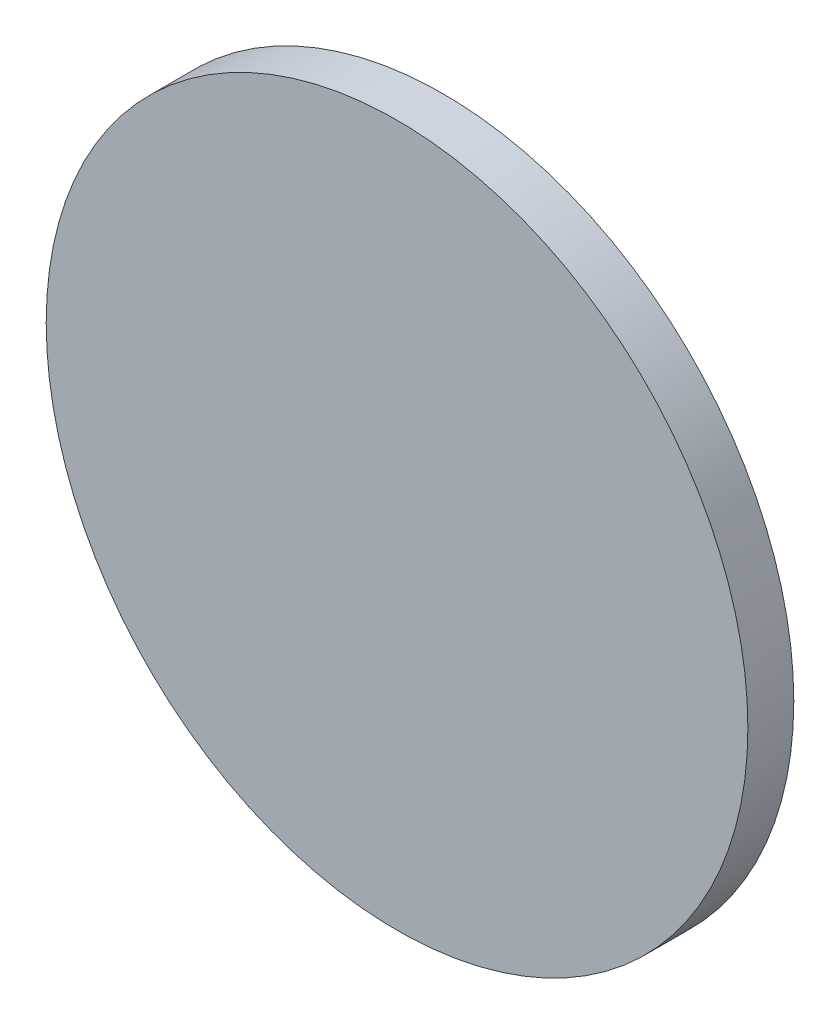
ISO-10303-21;
HEADER;
FILE_DESCRIPTION(('STEP AP214'),'2;1');
FILE_NAME('part.step','',(''),(''),'','','');
FILE_SCHEMA(('AUTOMOTIVE_DESIGN { 1 0 10303 214 1 1 1 1 }'));
ENDSEC;
DATA;
#1=APPLICATION_CONTEXT('core data for automotive mechanical design processes');
#2=APPLICATION_PROTOCOL_DEFINITION('international standard','automotive_design',2000,#1);
#3=PRODUCT_CONTEXT('',#1,'mechanical');
#4=PRODUCT('Part','Part','',(#3));
#5=PRODUCT_RELATED_PRODUCT_CATEGORY('part','',(#4));
#6=PRODUCT_DEFINITION_FORMATION('','',#4);
#7=PRODUCT_DEFINITION_CONTEXT('part definition',#1,'design');
#8=PRODUCT_DEFINITION('design','',#6,#7);
#9=PRODUCT_DEFINITION_SHAPE('','',#8);
#10=(LENGTH_UNIT() NAMED_UNIT(*) SI_UNIT(.MILLI.,.METRE.));
#11=(NAMED_UNIT(*) PLANE_ANGLE_UNIT() SI_UNIT($,.RADIAN.));
#12=(NAMED_UNIT(*) SI_UNIT($,.STERADIAN.) SOLID_ANGLE_UNIT());
#13=UNCERTAINTY_MEASURE_WITH_UNIT(LENGTH_MEASURE(1.E-05),#10,'distance_accuracy_value','');
#14=(GEOMETRIC_REPRESENTATION_CONTEXT(3) GLOBAL_UNCERTAINTY_ASSIGNED_CONTEXT((#13)) GLOBAL_UNIT_ASSIGNED_CONTEXT((#10,
#11,#12)) REPRESENTATION_CONTEXT('',''));
#15=CARTESIAN_POINT('',(0.,0.,0.));
#16=DIRECTION('',(0.,0.,1.));
#17=DIRECTION('',(1.,0.,0.));
#18=AXIS2_PLACEMENT_3D('',#15,#16,#17);
#19=CARTESIAN_POINT('',(0.,0.,-1.143));
#20=DIRECTION('',(0.,0.,-1.));
#21=DIRECTION('',(-1.,0.,0.));
#22=AXIS2_PLACEMENT_3D('',#19,#20,#21);
#23=PLANE('',#22);
#24=CARTESIAN_POINT('',(0.,0.,-1.143));
#25=DIRECTION('',(0.,0.,1.));
#26=DIRECTION('',(1.,0.,0.));
#27=AXIS2_PLACEMENT_3D('',#24,#25,#26);
#28=CIRCLE('',#27,17.4752);
#29=CARTESIAN_POINT('',(17.4752,0.,-1.143));
#30=VERTEX_POINT('',#29);
#31=EDGE_CURVE('E17',#30,#30,#28,.T.);
#32=ORIENTED_EDGE('',*,*,#31,.F.);
#33=EDGE_LOOP('',(#32));
#34=FACE_BOUND('',#33,.T.);
#35=ADVANCED_FACE('F14',(#34),#23,.T.);
#36=CARTESIAN_POINT('',(0.,0.,0.));
#37=DIRECTION('',(0.,0.,1.));
#38=DIRECTION('',(1.,0.,0.));
#39=AXIS2_PLACEMENT_3D('',#36,#37,#38);
#40=CYLINDRICAL_SURFACE('',#39,17.4752);
#41=CARTESIAN_POINT('',(0.,0.,1.143));
#42=DIRECTION('',(0.,0.,1.));
#43=DIRECTION('',(1.,0.,0.));
#44=AXIS2_PLACEMENT_3D('',#41,#42,#43);
#45=CIRCLE('',#44,17.4752);
#46=CARTESIAN_POINT('',(17.4752,0.,1.143));
#47=VERTEX_POINT('',#46);
#48=EDGE_CURVE('E10',#47,#47,#45,.F.);
#49=ORIENTED_EDGE('',*,*,#48,.T.);
#50=EDGE_LOOP('',(#49));
#51=FACE_BOUND('',#50,.T.);
#52=ORIENTED_EDGE('',*,*,#31,.T.);
#53=EDGE_LOOP('',(#52));
#54=FACE_BOUND('',#53,.T.);
#55=ADVANCED_FACE('F26',(#51,#54),#40,.T.);
#56=CARTESIAN_POINT('',(0.,0.,1.143));
#57=DIRECTION('',(0.,0.,-1.));
#58=DIRECTION('',(-1.,0.,0.));
#59=AXIS2_PLACEMENT_3D('',#56,#57,#58);
#60=PLANE('',#59);
#61=ORIENTED_EDGE('',*,*,#48,.F.);
#62=EDGE_LOOP('',(#61));
#63=FACE_BOUND('',#62,.T.);
#64=ADVANCED_FACE('F33',(#63),#60,.F.);
#65=CLOSED_SHELL('',(#35,#55,#64));
#66=MANIFOLD_SOLID_BREP('B1',#65);
#67=ADVANCED_BREP_SHAPE_REPRESENTATION('',(#18,#66),#14);
#68=SHAPE_DEFINITION_REPRESENTATION(#9,#67);
ENDSEC;
END-ISO-10303-21;
